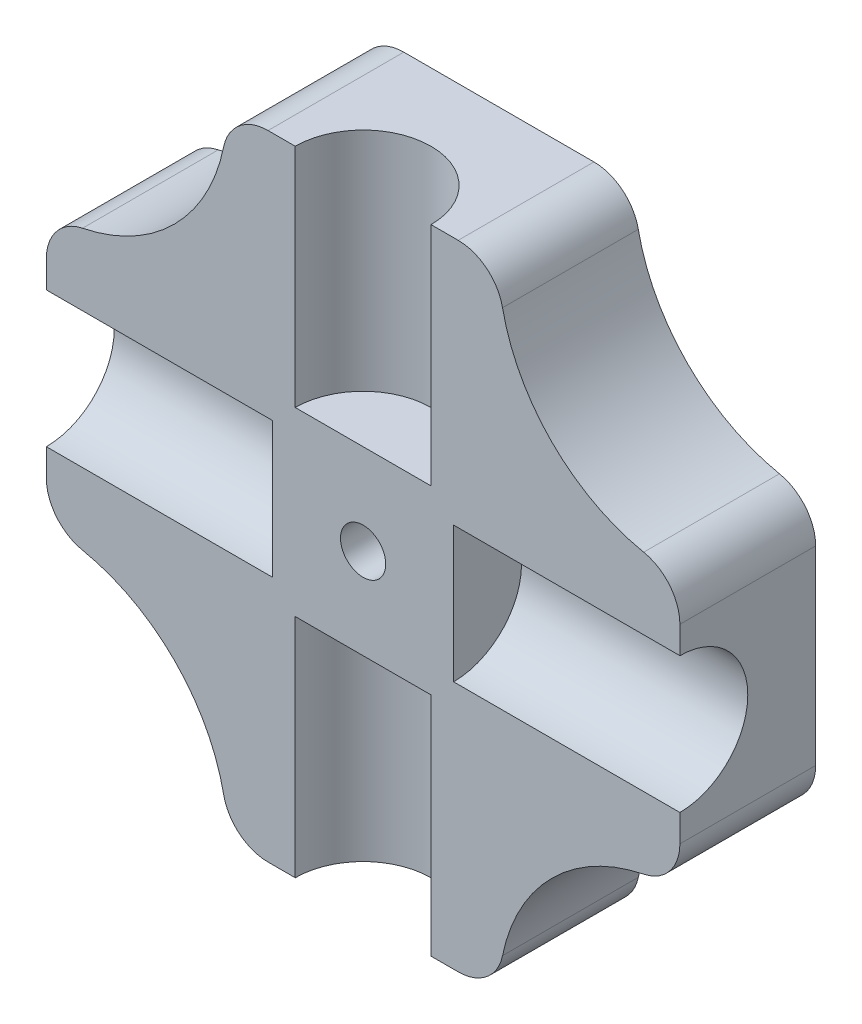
ISO-10303-21;
HEADER;
FILE_DESCRIPTION(('STEP AP214'),'2;1');
FILE_NAME('part.step','',(''),(''),'','','');
FILE_SCHEMA(('AUTOMOTIVE_DESIGN { 1 0 10303 214 1 1 1 1 }'));
ENDSEC;
DATA;
#1=APPLICATION_CONTEXT('core data for automotive mechanical design processes');
#2=APPLICATION_PROTOCOL_DEFINITION('international standard','automotive_design',2000,#1);
#3=PRODUCT_CONTEXT('',#1,'mechanical');
#4=PRODUCT('Part','Part','',(#3));
#5=PRODUCT_RELATED_PRODUCT_CATEGORY('part','',(#4));
#6=PRODUCT_DEFINITION_FORMATION('','',#4);
#7=PRODUCT_DEFINITION_CONTEXT('part definition',#1,'design');
#8=PRODUCT_DEFINITION('design','',#6,#7);
#9=PRODUCT_DEFINITION_SHAPE('','',#8);
#10=(LENGTH_UNIT() NAMED_UNIT(*) SI_UNIT(.MILLI.,.METRE.));
#11=(NAMED_UNIT(*) PLANE_ANGLE_UNIT() SI_UNIT($,.RADIAN.));
#12=(NAMED_UNIT(*) SI_UNIT($,.STERADIAN.) SOLID_ANGLE_UNIT());
#13=UNCERTAINTY_MEASURE_WITH_UNIT(LENGTH_MEASURE(1.E-05),#10,'distance_accuracy_value','');
#14=(GEOMETRIC_REPRESENTATION_CONTEXT(3) GLOBAL_UNCERTAINTY_ASSIGNED_CONTEXT((#13)) GLOBAL_UNIT_ASSIGNED_CONTEXT((#10,
#11,#12)) REPRESENTATION_CONTEXT('',''));
#15=CARTESIAN_POINT('',(0.,0.,0.));
#16=DIRECTION('',(0.,0.,1.));
#17=DIRECTION('',(1.,0.,0.));
#18=AXIS2_PLACEMENT_3D('',#15,#16,#17);
#19=CARTESIAN_POINT('',(-4.20204102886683,12.0000000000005,6.));
#20=DIRECTION('',(0.,0.,-1.));
#21=DIRECTION('',(-1.,0.,0.));
#22=AXIS2_PLACEMENT_3D('',#19,#20,#21);
#23=CYLINDRICAL_SURFACE('',#22,2.);
#24=CARTESIAN_POINT('',(-4.20204102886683,12.0000000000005,0.));
#25=DIRECTION('',(0.,0.,1.));
#26=DIRECTION('',(-1.,0.,0.));
#27=AXIS2_PLACEMENT_3D('',#24,#25,#26);
#28=CIRCLE('',#27,2.);
#29=CARTESIAN_POINT('',(-4.20204102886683,14.0000000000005,0.));
#30=VERTEX_POINT('',#29);
#31=CARTESIAN_POINT('',(-6.16163282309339,12.4000000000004,0.));
#32=VERTEX_POINT('',#31);
#33=EDGE_CURVE('E328',#30,#32,#28,.T.);
#34=ORIENTED_EDGE('',*,*,#33,.T.);
#35=DIRECTION('',(0.,0.,-1.));
#36=VECTOR('',#35,1.);
#37=CARTESIAN_POINT('',(-6.16163282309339,12.4000000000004,6.));
#38=LINE('',#37,#36);
#39=CARTESIAN_POINT('',(-6.16163282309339,12.4000000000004,6.));
#40=VERTEX_POINT('',#39);
#41=EDGE_CURVE('E268',#40,#32,#38,.T.);
#42=ORIENTED_EDGE('',*,*,#41,.F.);
#43=CARTESIAN_POINT('',(-4.20204102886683,12.0000000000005,6.));
#44=DIRECTION('',(0.,0.,1.));
#45=DIRECTION('',(-1.,0.,0.));
#46=AXIS2_PLACEMENT_3D('',#43,#44,#45);
#47=CIRCLE('',#46,2.);
#48=CARTESIAN_POINT('',(-4.20204102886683,14.0000000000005,6.));
#49=VERTEX_POINT('',#48);
#50=EDGE_CURVE('E364',#49,#40,#47,.T.);
#51=ORIENTED_EDGE('',*,*,#50,.F.);
#52=DIRECTION('',(0.,0.,-1.));
#53=VECTOR('',#52,1.);
#54=CARTESIAN_POINT('',(-4.20204102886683,14.0000000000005,6.));
#55=LINE('',#54,#53);
#56=EDGE_CURVE('E224',#49,#30,#55,.T.);
#57=ORIENTED_EDGE('',*,*,#56,.T.);
#58=EDGE_LOOP('',(#34,#42,#51,#57));
#59=FACE_BOUND('',#58,.T.);
#60=ADVANCED_FACE('F31',(#59),#23,.T.);
#61=CARTESIAN_POINT('',(-13.9999999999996,14.0000000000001,6.));
#62=DIRECTION('',(0.,0.,-1.));
#63=DIRECTION('',(-1.,0.,0.));
#64=AXIS2_PLACEMENT_3D('',#61,#62,#63);
#65=CYLINDRICAL_SURFACE('',#64,7.99999999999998);
#66=CARTESIAN_POINT('',(-13.9999999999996,14.0000000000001,0.));
#67=DIRECTION('',(0.,0.,-1.));
#68=DIRECTION('',(1.,0.,0.));
#69=AXIS2_PLACEMENT_3D('',#66,#67,#68);
#70=CIRCLE('',#69,7.99999999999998);
#71=CARTESIAN_POINT('',(-12.3999999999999,6.16163282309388,0.));
#72=VERTEX_POINT('',#71);
#73=EDGE_CURVE('E337',#32,#72,#70,.T.);
#74=ORIENTED_EDGE('',*,*,#73,.T.);
#75=DIRECTION('',(0.,0.,-1.));
#76=VECTOR('',#75,1.);
#77=CARTESIAN_POINT('',(-12.3999999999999,6.16163282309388,6.));
#78=LINE('',#77,#76);
#79=CARTESIAN_POINT('',(-12.3999999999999,6.16163282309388,6.));
#80=VERTEX_POINT('',#79);
#81=EDGE_CURVE('E265',#80,#72,#78,.T.);
#82=ORIENTED_EDGE('',*,*,#81,.F.);
#83=CARTESIAN_POINT('',(-13.9999999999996,14.0000000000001,6.));
#84=DIRECTION('',(0.,0.,-1.));
#85=DIRECTION('',(1.,0.,0.));
#86=AXIS2_PLACEMENT_3D('',#83,#84,#85);
#87=CIRCLE('',#86,7.99999999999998);
#88=EDGE_CURVE('E367',#40,#80,#87,.T.);
#89=ORIENTED_EDGE('',*,*,#88,.F.);
#90=ORIENTED_EDGE('',*,*,#41,.T.);
#91=EDGE_LOOP('',(#74,#82,#89,#90));
#92=FACE_BOUND('',#91,.T.);
#93=ADVANCED_FACE('F421',(#92),#65,.F.);
#94=CARTESIAN_POINT('',(-12.,4.20204102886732,6.));
#95=DIRECTION('',(0.,0.,-1.));
#96=DIRECTION('',(-1.,0.,0.));
#97=AXIS2_PLACEMENT_3D('',#94,#95,#96);
#98=CYLINDRICAL_SURFACE('',#97,2.);
#99=CARTESIAN_POINT('',(-12.,4.20204102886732,0.));
#100=DIRECTION('',(0.,0.,1.));
#101=DIRECTION('',(1.,0.,0.));
#102=AXIS2_PLACEMENT_3D('',#99,#100,#101);
#103=CIRCLE('',#102,2.);
#104=CARTESIAN_POINT('',(-14.,4.20204102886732,0.));
#105=VERTEX_POINT('',#104);
#106=EDGE_CURVE('E339',#72,#105,#103,.T.);
#107=ORIENTED_EDGE('',*,*,#106,.T.);
#108=DIRECTION('',(0.,0.,-1.));
#109=VECTOR('',#108,1.);
#110=CARTESIAN_POINT('',(-14.,4.20204102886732,6.));
#111=LINE('',#110,#109);
#112=CARTESIAN_POINT('',(-14.,4.20204102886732,6.));
#113=VERTEX_POINT('',#112);
#114=EDGE_CURVE('E262',#113,#105,#111,.T.);
#115=ORIENTED_EDGE('',*,*,#114,.F.);
#116=CARTESIAN_POINT('',(-12.,4.20204102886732,6.));
#117=DIRECTION('',(0.,0.,1.));
#118=DIRECTION('',(1.,0.,0.));
#119=AXIS2_PLACEMENT_3D('',#116,#117,#118);
#120=CIRCLE('',#119,2.);
#121=EDGE_CURVE('E369',#80,#113,#120,.T.);
#122=ORIENTED_EDGE('',*,*,#121,.F.);
#123=ORIENTED_EDGE('',*,*,#81,.T.);
#124=EDGE_LOOP('',(#107,#115,#122,#123));
#125=FACE_BOUND('',#124,.T.);
#126=ADVANCED_FACE('F425',(#125),#98,.T.);
#127=CARTESIAN_POINT('',(-14.,4.20204102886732,6.));
#128=DIRECTION('',(1.,0.,0.));
#129=DIRECTION('',(0.,1.,0.));
#130=AXIS2_PLACEMENT_3D('',#127,#128,#129);
#131=PLANE('',#130);
#132=DIRECTION('',(0.,-1.,0.));
#133=VECTOR('',#132,1.);
#134=CARTESIAN_POINT('',(-14.,4.20204102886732,6.));
#135=LINE('',#134,#133);
#136=CARTESIAN_POINT('',(-14.0000000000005,-3.00000000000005,6.));
#137=VERTEX_POINT('',#136);
#138=CARTESIAN_POINT('',(-14.,-4.20204102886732,6.));
#139=VERTEX_POINT('',#138);
#140=EDGE_CURVE('E371',#137,#139,#135,.T.);
#141=ORIENTED_EDGE('',*,*,#140,.F.);
#142=CARTESIAN_POINT('',(-14.0000000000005,0.,6.));
#143=DIRECTION('',(-1.,0.,0.));
#144=DIRECTION('',(0.,0.,1.));
#145=AXIS2_PLACEMENT_3D('',#142,#143,#144);
#146=CIRCLE('',#145,3.);
#147=CARTESIAN_POINT('',(-14.0000000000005,2.99999999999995,6.));
#148=VERTEX_POINT('',#147);
#149=EDGE_CURVE('E548',#148,#137,#146,.T.);
#150=ORIENTED_EDGE('',*,*,#149,.F.);
#151=EDGE_CURVE('E372',#113,#148,#135,.T.);
#152=ORIENTED_EDGE('',*,*,#151,.F.);
#153=ORIENTED_EDGE('',*,*,#114,.T.);
#154=DIRECTION('',(0.,-1.,0.));
#155=VECTOR('',#154,1.);
#156=CARTESIAN_POINT('',(-14.,4.20204102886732,0.));
#157=LINE('',#156,#155);
#158=CARTESIAN_POINT('',(-14.,-4.20204102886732,0.));
#159=VERTEX_POINT('',#158);
#160=EDGE_CURVE('E341',#105,#159,#157,.T.);
#161=ORIENTED_EDGE('',*,*,#160,.T.);
#162=DIRECTION('',(0.,0.,-1.));
#163=VECTOR('',#162,1.);
#164=CARTESIAN_POINT('',(-14.,-4.20204102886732,6.));
#165=LINE('',#164,#163);
#166=EDGE_CURVE('E259',#139,#159,#165,.T.);
#167=ORIENTED_EDGE('',*,*,#166,.F.);
#168=EDGE_LOOP('',(#141,#150,#152,#153,#161,#167));
#169=FACE_BOUND('',#168,.T.);
#170=ADVANCED_FACE('F430',(#169),#131,.F.);
#171=CARTESIAN_POINT('',(-12.,-4.20204102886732,6.));
#172=DIRECTION('',(0.,0.,-1.));
#173=DIRECTION('',(-1.,0.,0.));
#174=AXIS2_PLACEMENT_3D('',#171,#172,#173);
#175=CYLINDRICAL_SURFACE('',#174,2.);
#176=CARTESIAN_POINT('',(-12.,-4.20204102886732,0.));
#177=DIRECTION('',(0.,0.,1.));
#178=DIRECTION('',(1.,0.,0.));
#179=AXIS2_PLACEMENT_3D('',#176,#177,#178);
#180=CIRCLE('',#179,2.);
#181=CARTESIAN_POINT('',(-12.4,-6.16163282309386,0.));
#182=VERTEX_POINT('',#181);
#183=EDGE_CURVE('E343',#159,#182,#180,.T.);
#184=ORIENTED_EDGE('',*,*,#183,.T.);
#185=DIRECTION('',(0.,0.,-1.));
#186=VECTOR('',#185,1.);
#187=CARTESIAN_POINT('',(-12.4,-6.16163282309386,6.));
#188=LINE('',#187,#186);
#189=CARTESIAN_POINT('',(-12.4,-6.16163282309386,6.));
#190=VERTEX_POINT('',#189);
#191=EDGE_CURVE('E256',#190,#182,#188,.T.);
#192=ORIENTED_EDGE('',*,*,#191,.F.);
#193=CARTESIAN_POINT('',(-12.,-4.20204102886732,6.));
#194=DIRECTION('',(0.,0.,1.));
#195=DIRECTION('',(1.,0.,0.));
#196=AXIS2_PLACEMENT_3D('',#193,#194,#195);
#197=CIRCLE('',#196,2.);
#198=EDGE_CURVE('E375',#139,#190,#197,.T.);
#199=ORIENTED_EDGE('',*,*,#198,.F.);
#200=ORIENTED_EDGE('',*,*,#166,.T.);
#201=EDGE_LOOP('',(#184,#192,#199,#200));
#202=FACE_BOUND('',#201,.T.);
#203=ADVANCED_FACE('F436',(#202),#175,.T.);
#204=CARTESIAN_POINT('',(-14.0000000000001,-14.,6.));
#205=DIRECTION('',(0.,0.,-1.));
#206=DIRECTION('',(-1.,0.,0.));
#207=AXIS2_PLACEMENT_3D('',#204,#205,#206);
#208=CYLINDRICAL_SURFACE('',#207,7.99999999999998);
#209=CARTESIAN_POINT('',(-14.0000000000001,-14.,0.));
#210=DIRECTION('',(0.,0.,-1.));
#211=DIRECTION('',(1.,0.,0.));
#212=AXIS2_PLACEMENT_3D('',#209,#210,#211);
#213=CIRCLE('',#212,7.99999999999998);
#214=CARTESIAN_POINT('',(-6.16163282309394,-12.4,0.));
#215=VERTEX_POINT('',#214);
#216=EDGE_CURVE('E345',#182,#215,#213,.T.);
#217=ORIENTED_EDGE('',*,*,#216,.T.);
#218=DIRECTION('',(0.,0.,-1.));
#219=VECTOR('',#218,1.);
#220=CARTESIAN_POINT('',(-6.16163282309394,-12.4,6.));
#221=LINE('',#220,#219);
#222=CARTESIAN_POINT('',(-6.16163282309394,-12.4,6.));
#223=VERTEX_POINT('',#222);
#224=EDGE_CURVE('E253',#223,#215,#221,.T.);
#225=ORIENTED_EDGE('',*,*,#224,.F.);
#226=CARTESIAN_POINT('',(-14.0000000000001,-14.,6.));
#227=DIRECTION('',(0.,0.,-1.));
#228=DIRECTION('',(1.,0.,0.));
#229=AXIS2_PLACEMENT_3D('',#226,#227,#228);
#230=CIRCLE('',#229,7.99999999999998);
#231=EDGE_CURVE('E377',#190,#223,#230,.T.);
#232=ORIENTED_EDGE('',*,*,#231,.F.);
#233=ORIENTED_EDGE('',*,*,#191,.T.);
#234=EDGE_LOOP('',(#217,#225,#232,#233));
#235=FACE_BOUND('',#234,.T.);
#236=ADVANCED_FACE('F440',(#235),#208,.F.);
#237=CARTESIAN_POINT('',(-4.2020410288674,-12.,6.));
#238=DIRECTION('',(0.,0.,-1.));
#239=DIRECTION('',(-1.,0.,0.));
#240=AXIS2_PLACEMENT_3D('',#237,#238,#239);
#241=CYLINDRICAL_SURFACE('',#240,2.);
#242=CARTESIAN_POINT('',(-4.2020410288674,-12.,0.));
#243=DIRECTION('',(0.,0.,1.));
#244=DIRECTION('',(1.,0.,0.));
#245=AXIS2_PLACEMENT_3D('',#242,#243,#244);
#246=CIRCLE('',#245,2.);
#247=CARTESIAN_POINT('',(-4.2020410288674,-14.,0.));
#248=VERTEX_POINT('',#247);
#249=EDGE_CURVE('E347',#215,#248,#246,.T.);
#250=ORIENTED_EDGE('',*,*,#249,.T.);
#251=DIRECTION('',(0.,0.,-1.));
#252=VECTOR('',#251,1.);
#253=CARTESIAN_POINT('',(-4.2020410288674,-14.,6.));
#254=LINE('',#253,#252);
#255=CARTESIAN_POINT('',(-4.2020410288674,-14.,6.));
#256=VERTEX_POINT('',#255);
#257=EDGE_CURVE('E250',#256,#248,#254,.T.);
#258=ORIENTED_EDGE('',*,*,#257,.F.);
#259=CARTESIAN_POINT('',(-4.2020410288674,-12.,6.));
#260=DIRECTION('',(0.,0.,1.));
#261=DIRECTION('',(1.,0.,0.));
#262=AXIS2_PLACEMENT_3D('',#259,#260,#261);
#263=CIRCLE('',#262,2.);
#264=EDGE_CURVE('E379',#223,#256,#263,.T.);
#265=ORIENTED_EDGE('',*,*,#264,.F.);
#266=ORIENTED_EDGE('',*,*,#224,.T.);
#267=EDGE_LOOP('',(#250,#258,#265,#266));
#268=FACE_BOUND('',#267,.T.);
#269=ADVANCED_FACE('F444',(#268),#241,.T.);
#270=CARTESIAN_POINT('',(-4.2020410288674,-14.,6.));
#271=DIRECTION('',(0.,1.,0.));
#272=DIRECTION('',(0.,0.,1.));
#273=AXIS2_PLACEMENT_3D('',#270,#271,#272);
#274=PLANE('',#273);
#275=DIRECTION('',(1.,0.,0.));
#276=VECTOR('',#275,1.);
#277=CARTESIAN_POINT('',(-4.2020410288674,-14.,6.));
#278=LINE('',#277,#276);
#279=CARTESIAN_POINT('',(3.0000000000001,-14.0000000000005,6.));
#280=VERTEX_POINT('',#279);
#281=CARTESIAN_POINT('',(4.20204102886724,-14.,6.));
#282=VERTEX_POINT('',#281);
#283=EDGE_CURVE('E381',#280,#282,#278,.T.);
#284=ORIENTED_EDGE('',*,*,#283,.F.);
#285=CARTESIAN_POINT('',(0.,-14.0000000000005,6.));
#286=DIRECTION('',(0.,-1.,0.));
#287=DIRECTION('',(0.,0.,1.));
#288=AXIS2_PLACEMENT_3D('',#285,#286,#287);
#289=CIRCLE('',#288,3.);
#290=CARTESIAN_POINT('',(-2.9999999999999,-14.0000000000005,6.));
#291=VERTEX_POINT('',#290);
#292=EDGE_CURVE('E549',#291,#280,#289,.T.);
#293=ORIENTED_EDGE('',*,*,#292,.F.);
#294=EDGE_CURVE('E382',#256,#291,#278,.T.);
#295=ORIENTED_EDGE('',*,*,#294,.F.);
#296=ORIENTED_EDGE('',*,*,#257,.T.);
#297=DIRECTION('',(1.,0.,0.));
#298=VECTOR('',#297,1.);
#299=CARTESIAN_POINT('',(-4.2020410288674,-14.,0.));
#300=LINE('',#299,#298);
#301=CARTESIAN_POINT('',(4.20204102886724,-14.,0.));
#302=VERTEX_POINT('',#301);
#303=EDGE_CURVE('E349',#248,#302,#300,.T.);
#304=ORIENTED_EDGE('',*,*,#303,.T.);
#305=DIRECTION('',(0.,0.,-1.));
#306=VECTOR('',#305,1.);
#307=CARTESIAN_POINT('',(4.20204102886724,-14.,6.));
#308=LINE('',#307,#306);
#309=EDGE_CURVE('E247',#282,#302,#308,.T.);
#310=ORIENTED_EDGE('',*,*,#309,.F.);
#311=EDGE_LOOP('',(#284,#293,#295,#296,#304,#310));
#312=FACE_BOUND('',#311,.T.);
#313=ADVANCED_FACE('F448',(#312),#274,.F.);
#314=CARTESIAN_POINT('',(4.20204102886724,-12.,6.));
#315=DIRECTION('',(0.,0.,-1.));
#316=DIRECTION('',(-1.,0.,0.));
#317=AXIS2_PLACEMENT_3D('',#314,#315,#316);
#318=CYLINDRICAL_SURFACE('',#317,2.);
#319=CARTESIAN_POINT('',(4.20204102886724,-12.,0.));
#320=DIRECTION('',(0.,0.,1.));
#321=DIRECTION('',(-1.,0.,0.));
#322=AXIS2_PLACEMENT_3D('',#319,#320,#321);
#323=CIRCLE('',#322,2.);
#324=CARTESIAN_POINT('',(6.16163282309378,-12.4,0.));
#325=VERTEX_POINT('',#324);
#326=EDGE_CURVE('E351',#302,#325,#323,.T.);
#327=ORIENTED_EDGE('',*,*,#326,.T.);
#328=DIRECTION('',(0.,0.,-1.));
#329=VECTOR('',#328,1.);
#330=CARTESIAN_POINT('',(6.16163282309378,-12.4,6.));
#331=LINE('',#330,#329);
#332=CARTESIAN_POINT('',(6.16163282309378,-12.4,6.));
#333=VERTEX_POINT('',#332);
#334=EDGE_CURVE('E244',#333,#325,#331,.T.);
#335=ORIENTED_EDGE('',*,*,#334,.F.);
#336=CARTESIAN_POINT('',(4.20204102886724,-12.,6.));
#337=DIRECTION('',(0.,0.,1.));
#338=DIRECTION('',(-1.,0.,0.));
#339=AXIS2_PLACEMENT_3D('',#336,#337,#338);
#340=CIRCLE('',#339,2.);
#341=EDGE_CURVE('E385',#282,#333,#340,.T.);
#342=ORIENTED_EDGE('',*,*,#341,.F.);
#343=ORIENTED_EDGE('',*,*,#309,.T.);
#344=EDGE_LOOP('',(#327,#335,#342,#343));
#345=FACE_BOUND('',#344,.T.);
#346=ADVANCED_FACE('F452',(#345),#318,.T.);
#347=CARTESIAN_POINT('',(13.9999999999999,-14.,6.));
#348=DIRECTION('',(0.,0.,-1.));
#349=DIRECTION('',(-1.,0.,0.));
#350=AXIS2_PLACEMENT_3D('',#347,#348,#349);
#351=CYLINDRICAL_SURFACE('',#350,8.);
#352=CARTESIAN_POINT('',(13.9999999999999,-14.,0.));
#353=DIRECTION('',(0.,0.,-1.));
#354=DIRECTION('',(1.,0.,0.));
#355=AXIS2_PLACEMENT_3D('',#352,#353,#354);
#356=CIRCLE('',#355,8.);
#357=CARTESIAN_POINT('',(12.4,-6.16163282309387,0.));
#358=VERTEX_POINT('',#357);
#359=EDGE_CURVE('E353',#325,#358,#356,.T.);
#360=ORIENTED_EDGE('',*,*,#359,.T.);
#361=DIRECTION('',(0.,0.,-1.));
#362=VECTOR('',#361,1.);
#363=CARTESIAN_POINT('',(12.4,-6.16163282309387,6.));
#364=LINE('',#363,#362);
#365=CARTESIAN_POINT('',(12.4,-6.16163282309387,6.));
#366=VERTEX_POINT('',#365);
#367=EDGE_CURVE('E241',#366,#358,#364,.T.);
#368=ORIENTED_EDGE('',*,*,#367,.F.);
#369=CARTESIAN_POINT('',(13.9999999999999,-14.,6.));
#370=DIRECTION('',(0.,0.,-1.));
#371=DIRECTION('',(1.,0.,0.));
#372=AXIS2_PLACEMENT_3D('',#369,#370,#371);
#373=CIRCLE('',#372,8.);
#374=EDGE_CURVE('E386',#333,#366,#373,.T.);
#375=ORIENTED_EDGE('',*,*,#374,.F.);
#376=ORIENTED_EDGE('',*,*,#334,.T.);
#377=EDGE_LOOP('',(#360,#368,#375,#376));
#378=FACE_BOUND('',#377,.T.);
#379=ADVANCED_FACE('F392',(#378),#351,.F.);
#380=CARTESIAN_POINT('',(12.,-4.20204102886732,6.));
#381=DIRECTION('',(0.,0.,-1.));
#382=DIRECTION('',(-1.,0.,0.));
#383=AXIS2_PLACEMENT_3D('',#380,#381,#382);
#384=CYLINDRICAL_SURFACE('',#383,2.);
#385=CARTESIAN_POINT('',(12.,-4.20204102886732,0.));
#386=DIRECTION('',(0.,0.,1.));
#387=DIRECTION('',(1.,0.,0.));
#388=AXIS2_PLACEMENT_3D('',#385,#386,#387);
#389=CIRCLE('',#388,2.);
#390=CARTESIAN_POINT('',(14.,-4.20204102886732,0.));
#391=VERTEX_POINT('',#390);
#392=EDGE_CURVE('E355',#358,#391,#389,.T.);
#393=ORIENTED_EDGE('',*,*,#392,.T.);
#394=DIRECTION('',(0.,0.,-1.));
#395=VECTOR('',#394,1.);
#396=CARTESIAN_POINT('',(14.,-4.20204102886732,6.));
#397=LINE('',#396,#395);
#398=CARTESIAN_POINT('',(14.,-4.20204102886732,6.));
#399=VERTEX_POINT('',#398);
#400=EDGE_CURVE('E239',#399,#391,#397,.T.);
#401=ORIENTED_EDGE('',*,*,#400,.F.);
#402=CARTESIAN_POINT('',(12.,-4.20204102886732,6.));
#403=DIRECTION('',(0.,0.,1.));
#404=DIRECTION('',(1.,0.,0.));
#405=AXIS2_PLACEMENT_3D('',#402,#403,#404);
#406=CIRCLE('',#405,2.);
#407=EDGE_CURVE('E208',#366,#399,#406,.T.);
#408=ORIENTED_EDGE('',*,*,#407,.F.);
#409=ORIENTED_EDGE('',*,*,#367,.T.);
#410=EDGE_LOOP('',(#393,#401,#408,#409));
#411=FACE_BOUND('',#410,.T.);
#412=ADVANCED_FACE('F396',(#411),#384,.T.);
#413=CARTESIAN_POINT('',(14.,4.20204102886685,6.));
#414=DIRECTION('',(-1.,0.,0.));
#415=DIRECTION('',(0.,0.,1.));
#416=AXIS2_PLACEMENT_3D('',#413,#414,#415);
#417=PLANE('',#416);
#418=DIRECTION('',(0.,1.,0.));
#419=VECTOR('',#418,1.);
#420=CARTESIAN_POINT('',(14.,4.20204102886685,6.));
#421=LINE('',#420,#419);
#422=CARTESIAN_POINT('',(14.0000000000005,3.00000000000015,6.));
#423=VERTEX_POINT('',#422);
#424=CARTESIAN_POINT('',(14.,4.20204102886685,6.));
#425=VERTEX_POINT('',#424);
#426=EDGE_CURVE('E204',#423,#425,#421,.T.);
#427=ORIENTED_EDGE('',*,*,#426,.F.);
#428=CARTESIAN_POINT('',(14.0000000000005,1.46642301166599E-13,6.));
#429=DIRECTION('',(1.,0.,0.));
#430=DIRECTION('',(0.,0.,1.));
#431=AXIS2_PLACEMENT_3D('',#428,#429,#430);
#432=CIRCLE('',#431,3.);
#433=CARTESIAN_POINT('',(14.0000000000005,-2.99999999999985,6.));
#434=VERTEX_POINT('',#433);
#435=EDGE_CURVE('E192',#434,#423,#432,.T.);
#436=ORIENTED_EDGE('',*,*,#435,.F.);
#437=EDGE_CURVE('E202',#399,#434,#421,.T.);
#438=ORIENTED_EDGE('',*,*,#437,.F.);
#439=ORIENTED_EDGE('',*,*,#400,.T.);
#440=DIRECTION('',(0.,1.,0.));
#441=VECTOR('',#440,1.);
#442=CARTESIAN_POINT('',(14.,4.20204102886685,0.));
#443=LINE('',#442,#441);
#444=CARTESIAN_POINT('',(14.,4.20204102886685,0.));
#445=VERTEX_POINT('',#444);
#446=EDGE_CURVE('E299',#391,#445,#443,.T.);
#447=ORIENTED_EDGE('',*,*,#446,.T.);
#448=DIRECTION('',(0.,0.,-1.));
#449=VECTOR('',#448,1.);
#450=CARTESIAN_POINT('',(14.,4.20204102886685,6.));
#451=LINE('',#450,#449);
#452=EDGE_CURVE('E236',#425,#445,#451,.T.);
#453=ORIENTED_EDGE('',*,*,#452,.F.);
#454=EDGE_LOOP('',(#427,#436,#438,#439,#447,#453));
#455=FACE_BOUND('',#454,.T.);
#456=ADVANCED_FACE('F200',(#455),#417,.F.);
#457=CARTESIAN_POINT('',(12.,4.20204102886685,6.));
#458=DIRECTION('',(0.,0.,-1.));
#459=DIRECTION('',(-1.,0.,0.));
#460=AXIS2_PLACEMENT_3D('',#457,#458,#459);
#461=CYLINDRICAL_SURFACE('',#460,2.00000000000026);
#462=CARTESIAN_POINT('',(12.,4.20204102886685,0.));
#463=DIRECTION('',(0.,0.,1.));
#464=DIRECTION('',(-1.,0.,0.));
#465=AXIS2_PLACEMENT_3D('',#462,#463,#464);
#466=CIRCLE('',#465,2.00000000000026);
#467=CARTESIAN_POINT('',(12.4000000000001,6.16163282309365,0.));
#468=VERTEX_POINT('',#467);
#469=EDGE_CURVE('E304',#445,#468,#466,.T.);
#470=ORIENTED_EDGE('',*,*,#469,.T.);
#471=DIRECTION('',(0.,0.,-1.));
#472=VECTOR('',#471,1.);
#473=CARTESIAN_POINT('',(12.4000000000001,6.16163282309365,6.));
#474=LINE('',#473,#472);
#475=CARTESIAN_POINT('',(12.4000000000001,6.16163282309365,6.));
#476=VERTEX_POINT('',#475);
#477=EDGE_CURVE('E233',#476,#468,#474,.T.);
#478=ORIENTED_EDGE('',*,*,#477,.F.);
#479=CARTESIAN_POINT('',(12.,4.20204102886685,6.));
#480=DIRECTION('',(0.,0.,1.));
#481=DIRECTION('',(-1.,0.,0.));
#482=AXIS2_PLACEMENT_3D('',#479,#480,#481);
#483=CIRCLE('',#482,2.00000000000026);
#484=EDGE_CURVE('E210',#425,#476,#483,.T.);
#485=ORIENTED_EDGE('',*,*,#484,.F.);
#486=ORIENTED_EDGE('',*,*,#452,.T.);
#487=EDGE_LOOP('',(#470,#478,#485,#486));
#488=FACE_BOUND('',#487,.T.);
#489=ADVANCED_FACE('F302',(#488),#461,.T.);
#490=CARTESIAN_POINT('',(14.0000000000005,13.9999999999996,6.));
#491=DIRECTION('',(0.,0.,-1.));
#492=DIRECTION('',(-1.,0.,0.));
#493=AXIS2_PLACEMENT_3D('',#490,#491,#492);
#494=CYLINDRICAL_SURFACE('',#493,7.99999999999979);
#495=CARTESIAN_POINT('',(14.0000000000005,13.9999999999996,0.));
#496=DIRECTION('',(0.,0.,-1.));
#497=DIRECTION('',(1.,0.,0.));
#498=AXIS2_PLACEMENT_3D('',#495,#496,#497);
#499=CIRCLE('',#498,7.99999999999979);
#500=CARTESIAN_POINT('',(6.16163282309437,12.4000000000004,0.));
#501=VERTEX_POINT('',#500);
#502=EDGE_CURVE('E359',#468,#501,#499,.T.);
#503=ORIENTED_EDGE('',*,*,#502,.T.);
#504=DIRECTION('',(0.,0.,-1.));
#505=VECTOR('',#504,1.);
#506=CARTESIAN_POINT('',(6.16163282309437,12.4000000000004,6.));
#507=LINE('',#506,#505);
#508=CARTESIAN_POINT('',(6.16163282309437,12.4000000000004,6.));
#509=VERTEX_POINT('',#508);
#510=EDGE_CURVE('E230',#509,#501,#507,.T.);
#511=ORIENTED_EDGE('',*,*,#510,.F.);
#512=CARTESIAN_POINT('',(14.0000000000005,13.9999999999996,6.));
#513=DIRECTION('',(0.,0.,-1.));
#514=DIRECTION('',(1.,0.,0.));
#515=AXIS2_PLACEMENT_3D('',#512,#513,#514);
#516=CIRCLE('',#515,7.99999999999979);
#517=EDGE_CURVE('E212',#476,#509,#516,.T.);
#518=ORIENTED_EDGE('',*,*,#517,.F.);
#519=ORIENTED_EDGE('',*,*,#477,.T.);
#520=EDGE_LOOP('',(#503,#511,#518,#519));
#521=FACE_BOUND('',#520,.T.);
#522=ADVANCED_FACE('F308',(#521),#494,.F.);
#523=CARTESIAN_POINT('',(4.20204102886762,12.0000000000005,6.));
#524=DIRECTION('',(0.,0.,-1.));
#525=DIRECTION('',(-1.,0.,0.));
#526=AXIS2_PLACEMENT_3D('',#523,#524,#525);
#527=CYLINDRICAL_SURFACE('',#526,2.);
#528=CARTESIAN_POINT('',(4.20204102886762,12.0000000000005,0.));
#529=DIRECTION('',(0.,0.,1.));
#530=DIRECTION('',(-1.,0.,0.));
#531=AXIS2_PLACEMENT_3D('',#528,#529,#530);
#532=CIRCLE('',#531,2.);
#533=CARTESIAN_POINT('',(4.20204102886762,14.0000000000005,0.));
#534=VERTEX_POINT('',#533);
#535=EDGE_CURVE('E315',#501,#534,#532,.T.);
#536=ORIENTED_EDGE('',*,*,#535,.T.);
#537=DIRECTION('',(0.,0.,-1.));
#538=VECTOR('',#537,1.);
#539=CARTESIAN_POINT('',(4.20204102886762,14.0000000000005,6.));
#540=LINE('',#539,#538);
#541=CARTESIAN_POINT('',(4.20204102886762,14.0000000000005,6.));
#542=VERTEX_POINT('',#541);
#543=EDGE_CURVE('E227',#542,#534,#540,.T.);
#544=ORIENTED_EDGE('',*,*,#543,.F.);
#545=CARTESIAN_POINT('',(4.20204102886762,12.0000000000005,6.));
#546=DIRECTION('',(0.,0.,1.));
#547=DIRECTION('',(-1.,0.,0.));
#548=AXIS2_PLACEMENT_3D('',#545,#546,#547);
#549=CIRCLE('',#548,2.);
#550=EDGE_CURVE('E218',#509,#542,#549,.T.);
#551=ORIENTED_EDGE('',*,*,#550,.F.);
#552=ORIENTED_EDGE('',*,*,#510,.T.);
#553=EDGE_LOOP('',(#536,#544,#551,#552));
#554=FACE_BOUND('',#553,.T.);
#555=ADVANCED_FACE('F313',(#554),#527,.T.);
#556=CARTESIAN_POINT('',(-4.20204102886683,14.0000000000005,6.));
#557=DIRECTION('',(0.,-1.,0.));
#558=DIRECTION('',(0.,0.,-1.));
#559=AXIS2_PLACEMENT_3D('',#556,#557,#558);
#560=PLANE('',#559);
#561=DIRECTION('',(-1.,0.,0.));
#562=VECTOR('',#561,1.);
#563=CARTESIAN_POINT('',(-4.20204102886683,14.0000000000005,6.));
#564=LINE('',#563,#562);
#565=CARTESIAN_POINT('',(-3.,14.0000000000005,6.));
#566=VERTEX_POINT('',#565);
#567=EDGE_CURVE('E220',#566,#49,#564,.T.);
#568=ORIENTED_EDGE('',*,*,#567,.F.);
#569=CARTESIAN_POINT('',(0.,14.0000000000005,6.));
#570=DIRECTION('',(0.,1.,0.));
#571=DIRECTION('',(0.,0.,1.));
#572=AXIS2_PLACEMENT_3D('',#569,#570,#571);
#573=CIRCLE('',#572,3.);
#574=CARTESIAN_POINT('',(3.,14.0000000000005,6.));
#575=VERTEX_POINT('',#574);
#576=EDGE_CURVE('E321',#575,#566,#573,.T.);
#577=ORIENTED_EDGE('',*,*,#576,.F.);
#578=EDGE_CURVE('E221',#542,#575,#564,.T.);
#579=ORIENTED_EDGE('',*,*,#578,.F.);
#580=ORIENTED_EDGE('',*,*,#543,.T.);
#581=DIRECTION('',(-1.,0.,0.));
#582=VECTOR('',#581,1.);
#583=CARTESIAN_POINT('',(-4.20204102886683,14.0000000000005,0.));
#584=LINE('',#583,#582);
#585=EDGE_CURVE('E362',#534,#30,#584,.T.);
#586=ORIENTED_EDGE('',*,*,#585,.T.);
#587=ORIENTED_EDGE('',*,*,#56,.F.);
#588=EDGE_LOOP('',(#568,#577,#579,#580,#586,#587));
#589=FACE_BOUND('',#588,.T.);
#590=ADVANCED_FACE('F320',(#589),#560,.F.);
#591=CARTESIAN_POINT('',(-4.20204102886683,12.0000000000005,6.));
#592=DIRECTION('',(0.,0.,-1.));
#593=DIRECTION('',(-1.,0.,0.));
#594=AXIS2_PLACEMENT_3D('',#591,#592,#593);
#595=PLANE('',#594);
#596=CARTESIAN_POINT('',(0.,0.,6.));
#597=DIRECTION('',(0.,0.,1.));
#598=DIRECTION('',(1.,0.,0.));
#599=AXIS2_PLACEMENT_3D('',#596,#597,#598);
#600=CIRCLE('',#599,1.);
#601=CARTESIAN_POINT('',(1.,0.,6.));
#602=VERTEX_POINT('',#601);
#603=EDGE_CURVE('E331',#602,#602,#600,.T.);
#604=ORIENTED_EDGE('',*,*,#603,.F.);
#605=EDGE_LOOP('',(#604));
#606=FACE_BOUND('',#605,.T.);
#607=DIRECTION('',(0.,-1.,0.));
#608=VECTOR('',#607,1.);
#609=CARTESIAN_POINT('',(4.00000000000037,12.0000000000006,6.));
#610=LINE('',#609,#608);
#611=CARTESIAN_POINT('',(4.00000000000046,3.00000000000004,6.));
#612=VERTEX_POINT('',#611);
#613=CARTESIAN_POINT('',(4.00000000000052,-2.99999999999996,6.));
#614=VERTEX_POINT('',#613);
#615=EDGE_CURVE('E196',#612,#614,#610,.T.);
#616=ORIENTED_EDGE('',*,*,#615,.F.);
#617=DIRECTION('',(1.,0.,0.));
#618=VECTOR('',#617,1.);
#619=CARTESIAN_POINT('',(4.00000000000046,3.00000000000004,6.));
#620=LINE('',#619,#618);
#621=EDGE_CURVE('E11',#612,#423,#620,.T.);
#622=ORIENTED_EDGE('',*,*,#621,.T.);
#623=ORIENTED_EDGE('',*,*,#426,.T.);
#624=ORIENTED_EDGE('',*,*,#484,.T.);
#625=ORIENTED_EDGE('',*,*,#517,.T.);
#626=ORIENTED_EDGE('',*,*,#550,.T.);
#627=ORIENTED_EDGE('',*,*,#578,.T.);
#628=DIRECTION('',(0.,1.,0.));
#629=VECTOR('',#628,1.);
#630=CARTESIAN_POINT('',(3.,4.00000000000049,6.));
#631=LINE('',#630,#629);
#632=CARTESIAN_POINT('',(3.,4.00000000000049,6.));
#633=VERTEX_POINT('',#632);
#634=EDGE_CURVE('E273',#575,#633,#631,.F.);
#635=ORIENTED_EDGE('',*,*,#634,.T.);
#636=DIRECTION('',(1.,0.,0.));
#637=VECTOR('',#636,1.);
#638=CARTESIAN_POINT('',(-4.20204102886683,4.00000000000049,6.));
#639=LINE('',#638,#637);
#640=CARTESIAN_POINT('',(-3.,4.00000000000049,6.));
#641=VERTEX_POINT('',#640);
#642=EDGE_CURVE('E271',#641,#633,#639,.T.);
#643=ORIENTED_EDGE('',*,*,#642,.F.);
#644=DIRECTION('',(0.,1.,0.));
#645=VECTOR('',#644,1.);
#646=CARTESIAN_POINT('',(-3.,4.00000000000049,6.));
#647=LINE('',#646,#645);
#648=EDGE_CURVE('E276',#641,#566,#647,.T.);
#649=ORIENTED_EDGE('',*,*,#648,.T.);
#650=ORIENTED_EDGE('',*,*,#567,.T.);
#651=ORIENTED_EDGE('',*,*,#50,.T.);
#652=ORIENTED_EDGE('',*,*,#88,.T.);
#653=ORIENTED_EDGE('',*,*,#121,.T.);
#654=ORIENTED_EDGE('',*,*,#151,.T.);
#655=DIRECTION('',(-1.,0.,0.));
#656=VECTOR('',#655,1.);
#657=CARTESIAN_POINT('',(-4.0000000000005,2.99999999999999,6.));
#658=LINE('',#657,#656);
#659=CARTESIAN_POINT('',(-4.0000000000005,2.99999999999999,6.));
#660=VERTEX_POINT('',#659);
#661=EDGE_CURVE('E281',#148,#660,#658,.F.);
#662=ORIENTED_EDGE('',*,*,#661,.T.);
#663=DIRECTION('',(0.,1.,0.));
#664=VECTOR('',#663,1.);
#665=CARTESIAN_POINT('',(-4.00000000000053,12.0000000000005,6.));
#666=LINE('',#665,#664);
#667=CARTESIAN_POINT('',(-4.00000000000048,-3.00000000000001,6.));
#668=VERTEX_POINT('',#667);
#669=EDGE_CURVE('E279',#668,#660,#666,.T.);
#670=ORIENTED_EDGE('',*,*,#669,.F.);
#671=DIRECTION('',(-1.,0.,0.));
#672=VECTOR('',#671,1.);
#673=CARTESIAN_POINT('',(-4.00000000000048,-3.00000000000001,6.));
#674=LINE('',#673,#672);
#675=EDGE_CURVE('E284',#668,#137,#674,.T.);
#676=ORIENTED_EDGE('',*,*,#675,.T.);
#677=ORIENTED_EDGE('',*,*,#140,.T.);
#678=ORIENTED_EDGE('',*,*,#198,.T.);
#679=ORIENTED_EDGE('',*,*,#231,.T.);
#680=ORIENTED_EDGE('',*,*,#264,.T.);
#681=ORIENTED_EDGE('',*,*,#294,.T.);
#682=DIRECTION('',(0.,-1.,0.));
#683=VECTOR('',#682,1.);
#684=CARTESIAN_POINT('',(-2.99999999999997,-4.00000000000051,6.));
#685=LINE('',#684,#683);
#686=CARTESIAN_POINT('',(-2.99999999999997,-4.00000000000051,6.));
#687=VERTEX_POINT('',#686);
#688=EDGE_CURVE('E289',#291,#687,#685,.F.);
#689=ORIENTED_EDGE('',*,*,#688,.T.);
#690=DIRECTION('',(-1.,0.,0.));
#691=VECTOR('',#690,1.);
#692=CARTESIAN_POINT('',(-4.20204102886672,-4.00000000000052,6.));
#693=LINE('',#692,#691);
#694=CARTESIAN_POINT('',(3.00000000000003,-4.00000000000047,6.));
#695=VERTEX_POINT('',#694);
#696=EDGE_CURVE('E287',#695,#687,#693,.T.);
#697=ORIENTED_EDGE('',*,*,#696,.F.);
#698=DIRECTION('',(0.,-1.,0.));
#699=VECTOR('',#698,1.);
#700=CARTESIAN_POINT('',(3.00000000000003,-4.00000000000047,6.));
#701=LINE('',#700,#699);
#702=EDGE_CURVE('E292',#695,#280,#701,.T.);
#703=ORIENTED_EDGE('',*,*,#702,.T.);
#704=ORIENTED_EDGE('',*,*,#283,.T.);
#705=ORIENTED_EDGE('',*,*,#341,.T.);
#706=ORIENTED_EDGE('',*,*,#374,.T.);
#707=ORIENTED_EDGE('',*,*,#407,.T.);
#708=ORIENTED_EDGE('',*,*,#437,.T.);
#709=DIRECTION('',(1.,0.,0.));
#710=VECTOR('',#709,1.);
#711=CARTESIAN_POINT('',(4.00000000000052,-2.99999999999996,6.));
#712=LINE('',#711,#710);
#713=EDGE_CURVE('E38',#434,#614,#712,.F.);
#714=ORIENTED_EDGE('',*,*,#713,.T.);
#715=EDGE_LOOP('',(#616,#622,#623,#624,#625,#626,#627,#635,#643,#649,#650,#651,#652,#653,#654,
#662,#670,#676,#677,#678,#679,#680,#681,#689,#697,#703,#704,#705,#706,#707,#708,#714));
#716=FACE_BOUND('',#715,.T.);
#717=ADVANCED_FACE('F206',(#606,#716),#595,.F.);
#718=CARTESIAN_POINT('',(-4.20204102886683,12.0000000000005,0.));
#719=DIRECTION('',(0.,0.,-1.));
#720=DIRECTION('',(-1.,0.,0.));
#721=AXIS2_PLACEMENT_3D('',#718,#719,#720);
#722=PLANE('',#721);
#723=ORIENTED_EDGE('',*,*,#33,.F.);
#724=ORIENTED_EDGE('',*,*,#585,.F.);
#725=ORIENTED_EDGE('',*,*,#535,.F.);
#726=ORIENTED_EDGE('',*,*,#502,.F.);
#727=ORIENTED_EDGE('',*,*,#469,.F.);
#728=ORIENTED_EDGE('',*,*,#446,.F.);
#729=ORIENTED_EDGE('',*,*,#392,.F.);
#730=ORIENTED_EDGE('',*,*,#359,.F.);
#731=ORIENTED_EDGE('',*,*,#326,.F.);
#732=ORIENTED_EDGE('',*,*,#303,.F.);
#733=ORIENTED_EDGE('',*,*,#249,.F.);
#734=ORIENTED_EDGE('',*,*,#216,.F.);
#735=ORIENTED_EDGE('',*,*,#183,.F.);
#736=ORIENTED_EDGE('',*,*,#160,.F.);
#737=ORIENTED_EDGE('',*,*,#106,.F.);
#738=ORIENTED_EDGE('',*,*,#73,.F.);
#739=EDGE_LOOP('',(#723,#724,#725,#726,#727,#728,#729,#730,#731,#732,#733,#734,#735,#736,#737,#738));
#740=FACE_BOUND('',#739,.T.);
#741=ADVANCED_FACE('F399',(#740),#722,.T.);
#742=CARTESIAN_POINT('',(0.,4.00000000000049,6.));
#743=DIRECTION('',(0.,1.,0.));
#744=DIRECTION('',(0.,0.,1.));
#745=AXIS2_PLACEMENT_3D('',#742,#743,#744);
#746=CYLINDRICAL_SURFACE('',#745,3.);
#747=CARTESIAN_POINT('',(0.,4.00000000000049,6.));
#748=DIRECTION('',(0.,1.,0.));
#749=DIRECTION('',(0.,0.,1.));
#750=AXIS2_PLACEMENT_3D('',#747,#748,#749);
#751=CIRCLE('',#750,3.);
#752=EDGE_CURVE('E325',#633,#641,#751,.T.);
#753=ORIENTED_EDGE('',*,*,#752,.F.);
#754=ORIENTED_EDGE('',*,*,#634,.F.);
#755=ORIENTED_EDGE('',*,*,#576,.T.);
#756=ORIENTED_EDGE('',*,*,#648,.F.);
#757=EDGE_LOOP('',(#753,#754,#755,#756));
#758=FACE_BOUND('',#757,.T.);
#759=ADVANCED_FACE('F406',(#758),#746,.F.);
#760=CARTESIAN_POINT('',(0.,4.00000000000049,6.));
#761=DIRECTION('',(0.,1.,0.));
#762=DIRECTION('',(0.,0.,1.));
#763=AXIS2_PLACEMENT_3D('',#760,#761,#762);
#764=PLANE('',#763);
#765=ORIENTED_EDGE('',*,*,#642,.T.);
#766=ORIENTED_EDGE('',*,*,#752,.T.);
#767=EDGE_LOOP('',(#765,#766));
#768=FACE_BOUND('',#767,.T.);
#769=ADVANCED_FACE('F408',(#768),#764,.T.);
#770=CARTESIAN_POINT('',(0.,0.,4.));
#771=DIRECTION('',(0.,0.,1.));
#772=DIRECTION('',(1.,0.,0.));
#773=AXIS2_PLACEMENT_3D('',#770,#771,#772);
#774=CYLINDRICAL_SURFACE('',#773,1.);
#775=CARTESIAN_POINT('',(0.,0.,4.));
#776=DIRECTION('',(0.,0.,1.));
#777=DIRECTION('',(1.,0.,0.));
#778=AXIS2_PLACEMENT_3D('',#775,#776,#777);
#779=CIRCLE('',#778,1.);
#780=CARTESIAN_POINT('',(1.,0.,4.));
#781=VERTEX_POINT('',#780);
#782=EDGE_CURVE('E326',#781,#781,#779,.T.);
#783=ORIENTED_EDGE('',*,*,#782,.F.);
#784=EDGE_LOOP('',(#783));
#785=FACE_BOUND('',#784,.T.);
#786=ORIENTED_EDGE('',*,*,#603,.T.);
#787=EDGE_LOOP('',(#786));
#788=FACE_BOUND('',#787,.T.);
#789=ADVANCED_FACE('F410',(#785,#788),#774,.F.);
#790=CARTESIAN_POINT('',(0.,0.,4.));
#791=DIRECTION('',(0.,0.,1.));
#792=DIRECTION('',(1.,0.,0.));
#793=AXIS2_PLACEMENT_3D('',#790,#791,#792);
#794=PLANE('',#793);
#795=ORIENTED_EDGE('',*,*,#782,.T.);
#796=EDGE_LOOP('',(#795));
#797=FACE_BOUND('',#796,.T.);
#798=ADVANCED_FACE('F416',(#797),#794,.T.);
#799=CARTESIAN_POINT('',(-4.00000000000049,0.,6.));
#800=DIRECTION('',(-1.,0.,0.));
#801=DIRECTION('',(0.,-1.,0.));
#802=AXIS2_PLACEMENT_3D('',#799,#800,#801);
#803=CYLINDRICAL_SURFACE('',#802,3.);
#804=CARTESIAN_POINT('',(-4.00000000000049,0.,6.));
#805=DIRECTION('',(-1.,0.,0.));
#806=DIRECTION('',(0.,0.,1.));
#807=AXIS2_PLACEMENT_3D('',#804,#805,#806);
#808=CIRCLE('',#807,3.);
#809=EDGE_CURVE('E561',#660,#668,#808,.T.);
#810=ORIENTED_EDGE('',*,*,#809,.F.);
#811=ORIENTED_EDGE('',*,*,#661,.F.);
#812=ORIENTED_EDGE('',*,*,#149,.T.);
#813=ORIENTED_EDGE('',*,*,#675,.F.);
#814=EDGE_LOOP('',(#810,#811,#812,#813));
#815=FACE_BOUND('',#814,.T.);
#816=ADVANCED_FACE('F501',(#815),#803,.F.);
#817=CARTESIAN_POINT('',(-4.00000000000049,0.,6.));
#818=DIRECTION('',(-1.,0.,0.));
#819=DIRECTION('',(0.,0.,1.));
#820=AXIS2_PLACEMENT_3D('',#817,#818,#819);
#821=PLANE('',#820);
#822=ORIENTED_EDGE('',*,*,#669,.T.);
#823=ORIENTED_EDGE('',*,*,#809,.T.);
#824=EDGE_LOOP('',(#822,#823));
#825=FACE_BOUND('',#824,.T.);
#826=ADVANCED_FACE('F509',(#825),#821,.T.);
#827=CARTESIAN_POINT('',(0.,-4.00000000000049,6.));
#828=DIRECTION('',(0.,-1.,0.));
#829=DIRECTION('',(1.,0.,0.));
#830=AXIS2_PLACEMENT_3D('',#827,#828,#829);
#831=CYLINDRICAL_SURFACE('',#830,3.);
#832=CARTESIAN_POINT('',(0.,-4.00000000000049,6.));
#833=DIRECTION('',(0.,-1.,0.));
#834=DIRECTION('',(0.,0.,1.));
#835=AXIS2_PLACEMENT_3D('',#832,#833,#834);
#836=CIRCLE('',#835,3.);
#837=EDGE_CURVE('E51',#687,#695,#836,.T.);
#838=ORIENTED_EDGE('',*,*,#837,.F.);
#839=ORIENTED_EDGE('',*,*,#688,.F.);
#840=ORIENTED_EDGE('',*,*,#292,.T.);
#841=ORIENTED_EDGE('',*,*,#702,.F.);
#842=EDGE_LOOP('',(#838,#839,#840,#841));
#843=FACE_BOUND('',#842,.T.);
#844=ADVANCED_FACE('F517',(#843),#831,.F.);
#845=CARTESIAN_POINT('',(0.,-4.00000000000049,6.));
#846=DIRECTION('',(0.,-1.,0.));
#847=DIRECTION('',(0.,0.,1.));
#848=AXIS2_PLACEMENT_3D('',#845,#846,#847);
#849=PLANE('',#848);
#850=ORIENTED_EDGE('',*,*,#696,.T.);
#851=ORIENTED_EDGE('',*,*,#837,.T.);
#852=EDGE_LOOP('',(#850,#851));
#853=FACE_BOUND('',#852,.T.);
#854=ADVANCED_FACE('F525',(#853),#849,.T.);
#855=CARTESIAN_POINT('',(4.00000000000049,0.,6.));
#856=DIRECTION('',(1.,0.,0.));
#857=DIRECTION('',(0.,1.,0.));
#858=AXIS2_PLACEMENT_3D('',#855,#856,#857);
#859=CYLINDRICAL_SURFACE('',#858,3.);
#860=CARTESIAN_POINT('',(4.00000000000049,0.,6.));
#861=DIRECTION('',(1.,0.,0.));
#862=DIRECTION('',(0.,0.,1.));
#863=AXIS2_PLACEMENT_3D('',#860,#861,#862);
#864=CIRCLE('',#863,3.);
#865=EDGE_CURVE('E44',#614,#612,#864,.T.);
#866=ORIENTED_EDGE('',*,*,#865,.F.);
#867=ORIENTED_EDGE('',*,*,#713,.F.);
#868=ORIENTED_EDGE('',*,*,#435,.T.);
#869=ORIENTED_EDGE('',*,*,#621,.F.);
#870=EDGE_LOOP('',(#866,#867,#868,#869));
#871=FACE_BOUND('',#870,.T.);
#872=ADVANCED_FACE('F191',(#871),#859,.F.);
#873=CARTESIAN_POINT('',(4.00000000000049,0.,6.));
#874=DIRECTION('',(1.,0.,0.));
#875=DIRECTION('',(0.,0.,1.));
#876=AXIS2_PLACEMENT_3D('',#873,#874,#875);
#877=PLANE('',#876);
#878=ORIENTED_EDGE('',*,*,#615,.T.);
#879=ORIENTED_EDGE('',*,*,#865,.T.);
#880=EDGE_LOOP('',(#878,#879));
#881=FACE_BOUND('',#880,.T.);
#882=ADVANCED_FACE('F295',(#881),#877,.T.);
#883=CLOSED_SHELL('',(#60,#93,#126,#170,#203,#236,#269,#313,#346,#379,#412,#456,#489,#522,#555,
#590,#717,#741,#759,#769,#789,#798,#816,#826,#844,#854,#872,#882));
#884=MANIFOLD_SOLID_BREP('B2',#883);
#885=ADVANCED_BREP_SHAPE_REPRESENTATION('',(#18,#884),#14);
#886=SHAPE_DEFINITION_REPRESENTATION(#9,#885);
ENDSEC;
END-ISO-10303-21;
